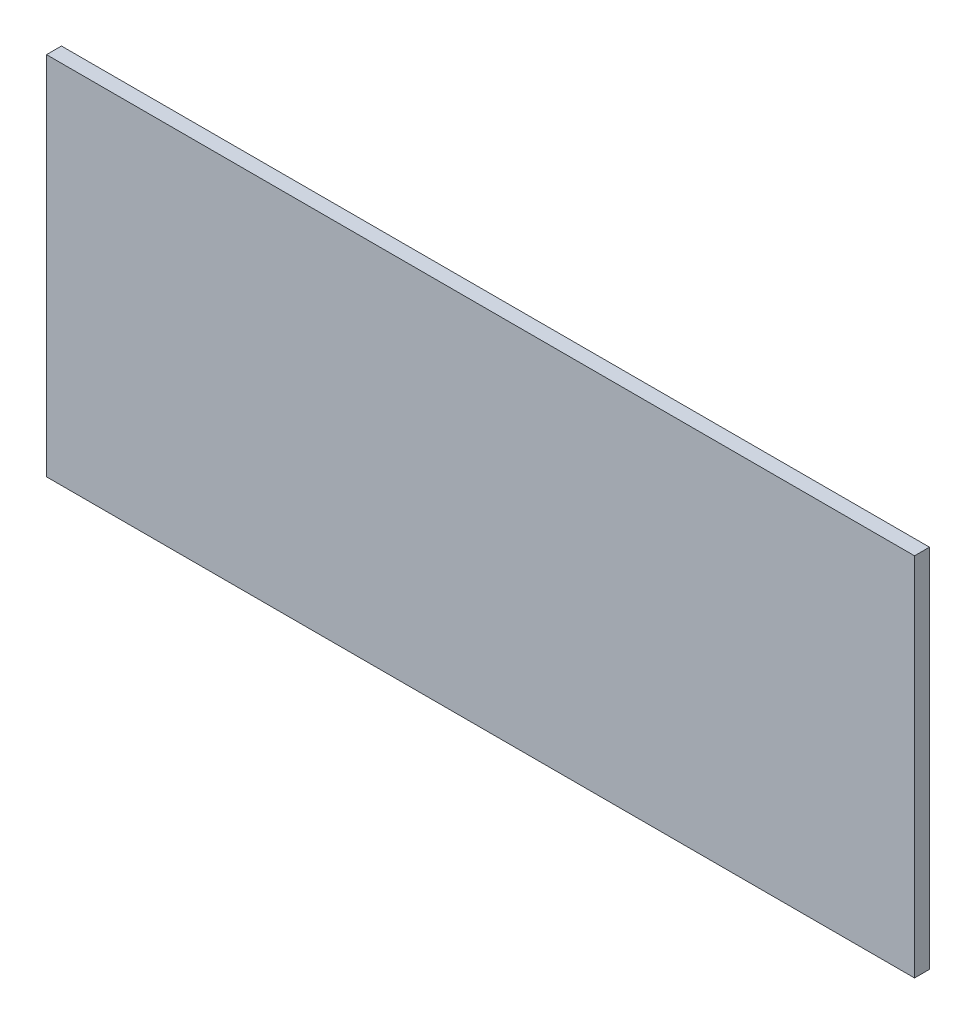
ISO-10303-21;
HEADER;
FILE_DESCRIPTION(('STEP AP214'),'2;1');
FILE_NAME('part.step','',(''),(''),'','','');
FILE_SCHEMA(('AUTOMOTIVE_DESIGN { 1 0 10303 214 1 1 1 1 }'));
ENDSEC;
DATA;
#1=APPLICATION_CONTEXT('core data for automotive mechanical design processes');
#2=APPLICATION_PROTOCOL_DEFINITION('international standard','automotive_design',2000,#1);
#3=PRODUCT_CONTEXT('',#1,'mechanical');
#4=PRODUCT('Part','Part','',(#3));
#5=PRODUCT_RELATED_PRODUCT_CATEGORY('part','',(#4));
#6=PRODUCT_DEFINITION_FORMATION('','',#4);
#7=PRODUCT_DEFINITION_CONTEXT('part definition',#1,'design');
#8=PRODUCT_DEFINITION('design','',#6,#7);
#9=PRODUCT_DEFINITION_SHAPE('','',#8);
#10=(LENGTH_UNIT() NAMED_UNIT(*) SI_UNIT(.MILLI.,.METRE.));
#11=(NAMED_UNIT(*) PLANE_ANGLE_UNIT() SI_UNIT($,.RADIAN.));
#12=(NAMED_UNIT(*) SI_UNIT($,.STERADIAN.) SOLID_ANGLE_UNIT());
#13=UNCERTAINTY_MEASURE_WITH_UNIT(LENGTH_MEASURE(1.E-05),#10,'distance_accuracy_value','');
#14=(GEOMETRIC_REPRESENTATION_CONTEXT(3) GLOBAL_UNCERTAINTY_ASSIGNED_CONTEXT((#13)) GLOBAL_UNIT_ASSIGNED_CONTEXT((#10,
#11,#12)) REPRESENTATION_CONTEXT('',''));
#15=CARTESIAN_POINT('',(0.,0.,0.));
#16=DIRECTION('',(0.,0.,1.));
#17=DIRECTION('',(1.,0.,0.));
#18=AXIS2_PLACEMENT_3D('',#15,#16,#17);
#19=CARTESIAN_POINT('',(-104.138862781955,10.8878745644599,10.));
#20=DIRECTION('',(1.,0.,0.));
#21=DIRECTION('',(0.,1.,0.));
#22=AXIS2_PLACEMENT_3D('',#19,#20,#21);
#23=PLANE('',#22);
#24=DIRECTION('',(0.,-1.,0.));
#25=VECTOR('',#24,1.);
#26=CARTESIAN_POINT('',(-104.138862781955,10.8878745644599,0.));
#27=LINE('',#26,#25);
#28=CARTESIAN_POINT('',(-104.138862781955,10.8878745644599,0.));
#29=VERTEX_POINT('',#28);
#30=CARTESIAN_POINT('',(-104.138862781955,-233.42212543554,0.));
#31=VERTEX_POINT('',#30);
#32=EDGE_CURVE('E96',#29,#31,#27,.T.);
#33=ORIENTED_EDGE('',*,*,#32,.T.);
#34=DIRECTION('',(0.,0.,-1.));
#35=VECTOR('',#34,1.);
#36=CARTESIAN_POINT('',(-104.138862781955,-233.42212543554,10.));
#37=LINE('',#36,#35);
#38=CARTESIAN_POINT('',(-104.138862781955,-233.42212543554,10.));
#39=VERTEX_POINT('',#38);
#40=EDGE_CURVE('E11',#39,#31,#37,.T.);
#41=ORIENTED_EDGE('',*,*,#40,.F.);
#42=DIRECTION('',(0.,-1.,0.));
#43=VECTOR('',#42,1.);
#44=CARTESIAN_POINT('',(-104.138862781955,10.8878745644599,10.));
#45=LINE('',#44,#43);
#46=CARTESIAN_POINT('',(-104.138862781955,10.8878745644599,10.));
#47=VERTEX_POINT('',#46);
#48=EDGE_CURVE('E84',#47,#39,#45,.T.);
#49=ORIENTED_EDGE('',*,*,#48,.F.);
#50=DIRECTION('',(0.,0.,-1.));
#51=VECTOR('',#50,1.);
#52=CARTESIAN_POINT('',(-104.138862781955,10.8878745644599,10.));
#53=LINE('',#52,#51);
#54=EDGE_CURVE('E92',#47,#29,#53,.T.);
#55=ORIENTED_EDGE('',*,*,#54,.T.);
#56=EDGE_LOOP('',(#33,#41,#49,#55));
#57=FACE_BOUND('',#56,.T.);
#58=ADVANCED_FACE('F33',(#57),#23,.F.);
#59=CARTESIAN_POINT('',(475.861137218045,-233.42212543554,10.));
#60=DIRECTION('',(0.,1.,0.));
#61=DIRECTION('',(-1.,0.,0.));
#62=AXIS2_PLACEMENT_3D('',#59,#60,#61);
#63=PLANE('',#62);
#64=DIRECTION('',(1.,0.,0.));
#65=VECTOR('',#64,1.);
#66=CARTESIAN_POINT('',(475.861137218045,-233.42212543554,0.));
#67=LINE('',#66,#65);
#68=CARTESIAN_POINT('',(475.861137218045,-233.42212543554,0.));
#69=VERTEX_POINT('',#68);
#70=EDGE_CURVE('E88',#31,#69,#67,.T.);
#71=ORIENTED_EDGE('',*,*,#70,.T.);
#72=DIRECTION('',(0.,0.,-1.));
#73=VECTOR('',#72,1.);
#74=CARTESIAN_POINT('',(475.861137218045,-233.42212543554,10.));
#75=LINE('',#74,#73);
#76=CARTESIAN_POINT('',(475.861137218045,-233.42212543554,10.));
#77=VERTEX_POINT('',#76);
#78=EDGE_CURVE('E41',#77,#69,#75,.T.);
#79=ORIENTED_EDGE('',*,*,#78,.F.);
#80=DIRECTION('',(1.,0.,0.));
#81=VECTOR('',#80,1.);
#82=CARTESIAN_POINT('',(475.861137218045,-233.42212543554,10.));
#83=LINE('',#82,#81);
#84=EDGE_CURVE('E79',#39,#77,#83,.T.);
#85=ORIENTED_EDGE('',*,*,#84,.F.);
#86=ORIENTED_EDGE('',*,*,#40,.T.);
#87=EDGE_LOOP('',(#71,#79,#85,#86));
#88=FACE_BOUND('',#87,.T.);
#89=ADVANCED_FACE('F87',(#88),#63,.F.);
#90=CARTESIAN_POINT('',(475.861137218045,-233.42212543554,10.));
#91=DIRECTION('',(-1.,0.,0.));
#92=DIRECTION('',(0.,-1.,0.));
#93=AXIS2_PLACEMENT_3D('',#90,#91,#92);
#94=PLANE('',#93);
#95=DIRECTION('',(0.,1.,0.));
#96=VECTOR('',#95,1.);
#97=CARTESIAN_POINT('',(475.861137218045,-233.42212543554,0.));
#98=LINE('',#97,#96);
#99=CARTESIAN_POINT('',(475.861137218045,10.88787456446,0.));
#100=VERTEX_POINT('',#99);
#101=EDGE_CURVE('E66',#69,#100,#98,.T.);
#102=ORIENTED_EDGE('',*,*,#101,.T.);
#103=DIRECTION('',(0.,0.,-1.));
#104=VECTOR('',#103,1.);
#105=CARTESIAN_POINT('',(475.861137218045,10.88787456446,10.));
#106=LINE('',#105,#104);
#107=CARTESIAN_POINT('',(475.861137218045,10.88787456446,10.));
#108=VERTEX_POINT('',#107);
#109=EDGE_CURVE('E89',#108,#100,#106,.T.);
#110=ORIENTED_EDGE('',*,*,#109,.F.);
#111=DIRECTION('',(0.,1.,0.));
#112=VECTOR('',#111,1.);
#113=CARTESIAN_POINT('',(475.861137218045,-233.42212543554,10.));
#114=LINE('',#113,#112);
#115=EDGE_CURVE('E82',#77,#108,#114,.T.);
#116=ORIENTED_EDGE('',*,*,#115,.F.);
#117=ORIENTED_EDGE('',*,*,#78,.T.);
#118=EDGE_LOOP('',(#102,#110,#116,#117));
#119=FACE_BOUND('',#118,.T.);
#120=ADVANCED_FACE('F90',(#119),#94,.F.);
#121=CARTESIAN_POINT('',(475.861137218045,10.88787456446,10.));
#122=DIRECTION('',(0.,-1.,0.));
#123=DIRECTION('',(1.,0.,0.));
#124=AXIS2_PLACEMENT_3D('',#121,#122,#123);
#125=PLANE('',#124);
#126=DIRECTION('',(-1.,0.,0.));
#127=VECTOR('',#126,1.);
#128=CARTESIAN_POINT('',(475.861137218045,10.88787456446,0.));
#129=LINE('',#128,#127);
#130=EDGE_CURVE('E72',#100,#29,#129,.T.);
#131=ORIENTED_EDGE('',*,*,#130,.T.);
#132=ORIENTED_EDGE('',*,*,#54,.F.);
#133=DIRECTION('',(-1.,0.,0.));
#134=VECTOR('',#133,1.);
#135=CARTESIAN_POINT('',(475.861137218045,10.88787456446,10.));
#136=LINE('',#135,#134);
#137=EDGE_CURVE('E49',#108,#47,#136,.T.);
#138=ORIENTED_EDGE('',*,*,#137,.F.);
#139=ORIENTED_EDGE('',*,*,#109,.T.);
#140=EDGE_LOOP('',(#131,#132,#138,#139));
#141=FACE_BOUND('',#140,.T.);
#142=ADVANCED_FACE('F103',(#141),#125,.F.);
#143=CARTESIAN_POINT('',(0.,0.,10.));
#144=DIRECTION('',(0.,0.,-1.));
#145=DIRECTION('',(-1.,0.,0.));
#146=AXIS2_PLACEMENT_3D('',#143,#144,#145);
#147=PLANE('',#146);
#148=ORIENTED_EDGE('',*,*,#48,.T.);
#149=ORIENTED_EDGE('',*,*,#84,.T.);
#150=ORIENTED_EDGE('',*,*,#115,.T.);
#151=ORIENTED_EDGE('',*,*,#137,.T.);
#152=EDGE_LOOP('',(#148,#149,#150,#151));
#153=FACE_BOUND('',#152,.T.);
#154=ADVANCED_FACE('F80',(#153),#147,.F.);
#155=CARTESIAN_POINT('',(0.,0.,0.));
#156=DIRECTION('',(0.,0.,-1.));
#157=DIRECTION('',(-1.,0.,0.));
#158=AXIS2_PLACEMENT_3D('',#155,#156,#157);
#159=PLANE('',#158);
#160=ORIENTED_EDGE('',*,*,#32,.F.);
#161=ORIENTED_EDGE('',*,*,#130,.F.);
#162=ORIENTED_EDGE('',*,*,#101,.F.);
#163=ORIENTED_EDGE('',*,*,#70,.F.);
#164=EDGE_LOOP('',(#160,#161,#162,#163));
#165=FACE_BOUND('',#164,.T.);
#166=ADVANCED_FACE('F106',(#165),#159,.T.);
#167=CLOSED_SHELL('',(#58,#89,#120,#142,#154,#166));
#168=MANIFOLD_SOLID_BREP('B2',#167);
#169=ADVANCED_BREP_SHAPE_REPRESENTATION('',(#18,#168),#14);
#170=SHAPE_DEFINITION_REPRESENTATION(#9,#169);
ENDSEC;
END-ISO-10303-21;
